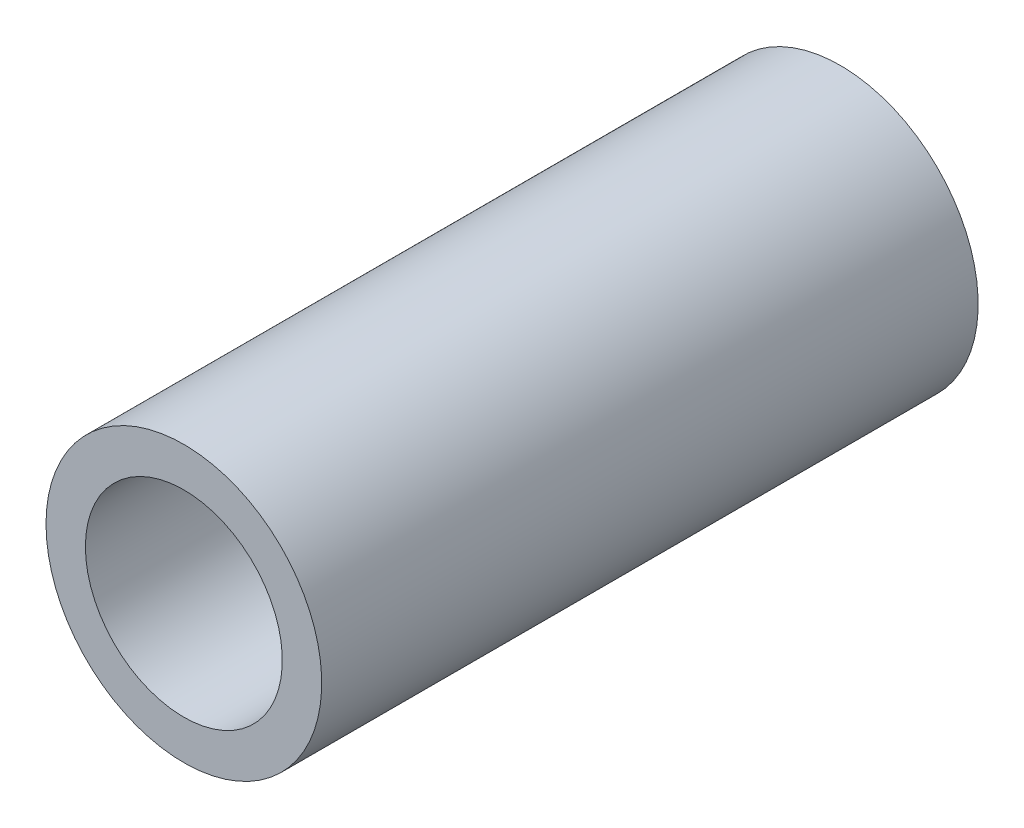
ISO-10303-21;
HEADER;
FILE_DESCRIPTION(('STEP AP214'),'2;1');
FILE_NAME('part.step','',(''),(''),'','','');
FILE_SCHEMA(('AUTOMOTIVE_DESIGN { 1 0 10303 214 1 1 1 1 }'));
ENDSEC;
DATA;
#1=APPLICATION_CONTEXT('core data for automotive mechanical design processes');
#2=APPLICATION_PROTOCOL_DEFINITION('international standard','automotive_design',2000,#1);
#3=PRODUCT_CONTEXT('',#1,'mechanical');
#4=PRODUCT('Part','Part','',(#3));
#5=PRODUCT_RELATED_PRODUCT_CATEGORY('part','',(#4));
#6=PRODUCT_DEFINITION_FORMATION('','',#4);
#7=PRODUCT_DEFINITION_CONTEXT('part definition',#1,'design');
#8=PRODUCT_DEFINITION('design','',#6,#7);
#9=PRODUCT_DEFINITION_SHAPE('','',#8);
#10=(LENGTH_UNIT() NAMED_UNIT(*) SI_UNIT(.MILLI.,.METRE.));
#11=(NAMED_UNIT(*) PLANE_ANGLE_UNIT() SI_UNIT($,.RADIAN.));
#12=(NAMED_UNIT(*) SI_UNIT($,.STERADIAN.) SOLID_ANGLE_UNIT());
#13=UNCERTAINTY_MEASURE_WITH_UNIT(LENGTH_MEASURE(1.E-05),#10,'distance_accuracy_value','');
#14=(GEOMETRIC_REPRESENTATION_CONTEXT(3) GLOBAL_UNCERTAINTY_ASSIGNED_CONTEXT((#13)) GLOBAL_UNIT_ASSIGNED_CONTEXT((#10,
#11,#12)) REPRESENTATION_CONTEXT('',''));
#15=CARTESIAN_POINT('',(0.,0.,0.));
#16=DIRECTION('',(0.,0.,1.));
#17=DIRECTION('',(1.,0.,0.));
#18=AXIS2_PLACEMENT_3D('',#15,#16,#17);
#19=CARTESIAN_POINT('',(0.,0.,100.));
#20=DIRECTION('',(0.,0.,1.));
#21=DIRECTION('',(1.,0.,0.));
#22=AXIS2_PLACEMENT_3D('',#19,#20,#21);
#23=PLANE('',#22);
#24=CARTESIAN_POINT('',(0.,0.,100.));
#25=DIRECTION('',(0.,0.,1.));
#26=DIRECTION('',(1.,0.,0.));
#27=AXIS2_PLACEMENT_3D('',#24,#25,#26);
#28=CIRCLE('',#27,21.);
#29=CARTESIAN_POINT('',(-21.,0.,100.));
#30=VERTEX_POINT('',#29);
#31=EDGE_CURVE('E11',#30,#30,#28,.T.);
#32=ORIENTED_EDGE('',*,*,#31,.T.);
#33=EDGE_LOOP('',(#32));
#34=FACE_BOUND('',#33,.T.);
#35=CARTESIAN_POINT('',(0.,0.,100.));
#36=DIRECTION('',(0.,0.,1.));
#37=DIRECTION('',(1.,0.,0.));
#38=AXIS2_PLACEMENT_3D('',#35,#36,#37);
#39=CIRCLE('',#38,15.);
#40=CARTESIAN_POINT('',(-15.,0.,100.));
#41=VERTEX_POINT('',#40);
#42=EDGE_CURVE('E50',#41,#41,#39,.T.);
#43=ORIENTED_EDGE('',*,*,#42,.F.);
#44=EDGE_LOOP('',(#43));
#45=FACE_BOUND('',#44,.T.);
#46=ADVANCED_FACE('F39',(#34,#45),#23,.T.);
#47=CARTESIAN_POINT('',(0.,0.,0.));
#48=DIRECTION('',(0.,0.,1.));
#49=DIRECTION('',(1.,0.,0.));
#50=AXIS2_PLACEMENT_3D('',#47,#48,#49);
#51=PLANE('',#50);
#52=CARTESIAN_POINT('',(0.,0.,0.));
#53=DIRECTION('',(0.,0.,1.));
#54=DIRECTION('',(1.,0.,0.));
#55=AXIS2_PLACEMENT_3D('',#52,#53,#54);
#56=CIRCLE('',#55,21.);
#57=CARTESIAN_POINT('',(-21.,0.,0.));
#58=VERTEX_POINT('',#57);
#59=EDGE_CURVE('E46',#58,#58,#56,.T.);
#60=ORIENTED_EDGE('',*,*,#59,.F.);
#61=EDGE_LOOP('',(#60));
#62=FACE_BOUND('',#61,.T.);
#63=CARTESIAN_POINT('',(0.,0.,0.));
#64=DIRECTION('',(0.,0.,1.));
#65=DIRECTION('',(1.,0.,0.));
#66=AXIS2_PLACEMENT_3D('',#63,#64,#65);
#67=CIRCLE('',#66,15.);
#68=CARTESIAN_POINT('',(-15.,0.,0.));
#69=VERTEX_POINT('',#68);
#70=EDGE_CURVE('E54',#69,#69,#67,.T.);
#71=ORIENTED_EDGE('',*,*,#70,.T.);
#72=EDGE_LOOP('',(#71));
#73=FACE_BOUND('',#72,.T.);
#74=ADVANCED_FACE('F60',(#62,#73),#51,.F.);
#75=CARTESIAN_POINT('',(0.,0.,100.));
#76=DIRECTION('',(0.,0.,-1.));
#77=DIRECTION('',(-1.,0.,0.));
#78=AXIS2_PLACEMENT_3D('',#75,#76,#77);
#79=CYLINDRICAL_SURFACE('',#78,21.);
#80=CARTESIAN_POINT('',(-21.,0.,100.));
#81=CARTESIAN_POINT('',(-21.,0.,98.9583333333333));
#82=CARTESIAN_POINT('',(-21.,0.,97.9166666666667));
#83=CARTESIAN_POINT('',(-21.,0.,95.8333333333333));
#84=CARTESIAN_POINT('',(-21.,0.,94.7916666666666));
#85=CARTESIAN_POINT('',(-21.,0.,92.7083333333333));
#86=CARTESIAN_POINT('',(-21.,0.,91.6666666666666));
#87=CARTESIAN_POINT('',(-21.,0.,89.5833333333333));
#88=CARTESIAN_POINT('',(-21.,0.,88.5416666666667));
#89=CARTESIAN_POINT('',(-21.,0.,86.4583333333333));
#90=CARTESIAN_POINT('',(-21.,0.,85.4166666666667));
#91=CARTESIAN_POINT('',(-21.,0.,83.3333333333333));
#92=CARTESIAN_POINT('',(-21.,0.,82.2916666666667));
#93=CARTESIAN_POINT('',(-21.,0.,80.2083333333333));
#94=CARTESIAN_POINT('',(-21.,0.,79.1666666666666));
#95=CARTESIAN_POINT('',(-21.,0.,77.0833333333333));
#96=CARTESIAN_POINT('',(-21.,0.,76.0416666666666));
#97=CARTESIAN_POINT('',(-21.,0.,73.9583333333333));
#98=CARTESIAN_POINT('',(-21.,0.,72.9166666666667));
#99=CARTESIAN_POINT('',(-21.,0.,70.8333333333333));
#100=CARTESIAN_POINT('',(-21.,0.,69.7916666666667));
#101=CARTESIAN_POINT('',(-21.,0.,67.7083333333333));
#102=CARTESIAN_POINT('',(-21.,0.,66.6666666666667));
#103=CARTESIAN_POINT('',(-21.,0.,64.5833333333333));
#104=CARTESIAN_POINT('',(-21.,0.,63.5416666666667));
#105=CARTESIAN_POINT('',(-21.,0.,61.4583333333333));
#106=CARTESIAN_POINT('',(-21.,0.,60.4166666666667));
#107=CARTESIAN_POINT('',(-21.,0.,58.3333333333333));
#108=CARTESIAN_POINT('',(-21.,0.,57.2916666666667));
#109=CARTESIAN_POINT('',(-21.,0.,55.2083333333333));
#110=CARTESIAN_POINT('',(-21.,0.,54.1666666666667));
#111=CARTESIAN_POINT('',(-21.,0.,52.0833333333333));
#112=CARTESIAN_POINT('',(-21.,0.,51.0416666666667));
#113=CARTESIAN_POINT('',(-21.,0.,48.9583333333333));
#114=CARTESIAN_POINT('',(-21.,0.,47.9166666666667));
#115=CARTESIAN_POINT('',(-21.,0.,45.8333333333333));
#116=CARTESIAN_POINT('',(-21.,0.,44.7916666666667));
#117=CARTESIAN_POINT('',(-21.,0.,42.7083333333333));
#118=CARTESIAN_POINT('',(-21.,0.,41.6666666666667));
#119=CARTESIAN_POINT('',(-21.,0.,39.5833333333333));
#120=CARTESIAN_POINT('',(-21.,0.,38.5416666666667));
#121=CARTESIAN_POINT('',(-21.,0.,36.4583333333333));
#122=CARTESIAN_POINT('',(-21.,0.,35.4166666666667));
#123=CARTESIAN_POINT('',(-21.,0.,33.3333333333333));
#124=CARTESIAN_POINT('',(-21.,0.,32.2916666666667));
#125=CARTESIAN_POINT('',(-21.,0.,30.2083333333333));
#126=CARTESIAN_POINT('',(-21.,0.,29.1666666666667));
#127=CARTESIAN_POINT('',(-21.,0.,27.0833333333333));
#128=CARTESIAN_POINT('',(-21.,0.,26.0416666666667));
#129=CARTESIAN_POINT('',(-21.,0.,23.9583333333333));
#130=CARTESIAN_POINT('',(-21.,0.,22.9166666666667));
#131=CARTESIAN_POINT('',(-21.,0.,20.8333333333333));
#132=CARTESIAN_POINT('',(-21.,0.,19.7916666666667));
#133=CARTESIAN_POINT('',(-21.,0.,17.7083333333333));
#134=CARTESIAN_POINT('',(-21.,0.,16.6666666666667));
#135=CARTESIAN_POINT('',(-21.,0.,14.5833333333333));
#136=CARTESIAN_POINT('',(-21.,0.,13.5416666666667));
#137=CARTESIAN_POINT('',(-21.,0.,11.4583333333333));
#138=CARTESIAN_POINT('',(-21.,0.,10.4166666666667));
#139=CARTESIAN_POINT('',(-21.,0.,8.33333333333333));
#140=CARTESIAN_POINT('',(-21.,0.,7.29166666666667));
#141=CARTESIAN_POINT('',(-21.,0.,5.20833333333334));
#142=CARTESIAN_POINT('',(-21.,0.,4.16666666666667));
#143=CARTESIAN_POINT('',(-21.,0.,2.08333333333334));
#144=CARTESIAN_POINT('',(-21.,0.,1.04166666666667));
#145=CARTESIAN_POINT('',(-21.,0.,0.));
#146=B_SPLINE_CURVE_WITH_KNOTS('',3,(#80,#81,#82,#83,#84,#85,#86,#87,#88,#89,#90,#91,#92,#93,
#94,#95,#96,#97,#98,#99,#100,#101,#102,#103,#104,#105,#106,#107,#108,#109,#110,#111,#112,#113,
#114,#115,#116,#117,#118,#119,#120,#121,#122,#123,#124,#125,#126,#127,#128,#129,#130,#131,#132,
#133,#134,#135,#136,#137,#138,#139,#140,#141,#142,#143,#144,#145),.UNSPECIFIED.,.F.,.F.,(4,2,2,
2,2,2,2,2,2,2,2,2,2,2,2,2,2,2,2,2,2,2,2,2,2,2,2,2,2,2,2,2,4),(0.,3.12499999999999,
6.24999999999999,9.37499999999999,12.5,15.625,18.75,21.875,25.,28.125,31.25,34.375,37.5,40.625,
43.75,46.875,50.,53.125,56.25,59.375,62.5,65.625,68.75,71.875,75.,78.125,81.25,84.375,87.5,
90.625,93.75,96.875,100.),.UNSPECIFIED.);
#147=EDGE_CURVE('BSEAM41',#30,#58,#146,.T.);
#148=ORIENTED_EDGE('',*,*,#31,.F.);
#149=ORIENTED_EDGE('',*,*,#59,.T.);
#150=ORIENTED_EDGE('',*,*,#147,.T.);
#151=ORIENTED_EDGE('',*,*,#147,.F.);
#152=EDGE_LOOP('',(#148,#150,#149,#151));
#153=FACE_BOUND('',#152,.T.);
#154=ADVANCED_FACE('F41',(#153),#79,.T.);
#155=CARTESIAN_POINT('',(0.,0.,100.));
#156=DIRECTION('',(0.,0.,-1.));
#157=DIRECTION('',(-1.,0.,0.));
#158=AXIS2_PLACEMENT_3D('',#155,#156,#157);
#159=CYLINDRICAL_SURFACE('',#158,15.);
#160=CARTESIAN_POINT('',(-15.,0.,100.));
#161=CARTESIAN_POINT('',(-15.,0.,98.9583333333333));
#162=CARTESIAN_POINT('',(-15.,0.,97.9166666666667));
#163=CARTESIAN_POINT('',(-15.,0.,95.8333333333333));
#164=CARTESIAN_POINT('',(-15.,0.,94.7916666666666));
#165=CARTESIAN_POINT('',(-15.,0.,92.7083333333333));
#166=CARTESIAN_POINT('',(-15.,0.,91.6666666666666));
#167=CARTESIAN_POINT('',(-15.,0.,89.5833333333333));
#168=CARTESIAN_POINT('',(-15.,0.,88.5416666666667));
#169=CARTESIAN_POINT('',(-15.,0.,86.4583333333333));
#170=CARTESIAN_POINT('',(-15.,0.,85.4166666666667));
#171=CARTESIAN_POINT('',(-15.,0.,83.3333333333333));
#172=CARTESIAN_POINT('',(-15.,0.,82.2916666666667));
#173=CARTESIAN_POINT('',(-15.,0.,80.2083333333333));
#174=CARTESIAN_POINT('',(-15.,0.,79.1666666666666));
#175=CARTESIAN_POINT('',(-15.,0.,77.0833333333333));
#176=CARTESIAN_POINT('',(-15.,0.,76.0416666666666));
#177=CARTESIAN_POINT('',(-15.,0.,73.9583333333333));
#178=CARTESIAN_POINT('',(-15.,0.,72.9166666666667));
#179=CARTESIAN_POINT('',(-15.,0.,70.8333333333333));
#180=CARTESIAN_POINT('',(-15.,0.,69.7916666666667));
#181=CARTESIAN_POINT('',(-15.,0.,67.7083333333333));
#182=CARTESIAN_POINT('',(-15.,0.,66.6666666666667));
#183=CARTESIAN_POINT('',(-15.,0.,64.5833333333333));
#184=CARTESIAN_POINT('',(-15.,0.,63.5416666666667));
#185=CARTESIAN_POINT('',(-15.,0.,61.4583333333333));
#186=CARTESIAN_POINT('',(-15.,0.,60.4166666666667));
#187=CARTESIAN_POINT('',(-15.,0.,58.3333333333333));
#188=CARTESIAN_POINT('',(-15.,0.,57.2916666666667));
#189=CARTESIAN_POINT('',(-15.,0.,55.2083333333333));
#190=CARTESIAN_POINT('',(-15.,0.,54.1666666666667));
#191=CARTESIAN_POINT('',(-15.,0.,52.0833333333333));
#192=CARTESIAN_POINT('',(-15.,0.,51.0416666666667));
#193=CARTESIAN_POINT('',(-15.,0.,48.9583333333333));
#194=CARTESIAN_POINT('',(-15.,0.,47.9166666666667));
#195=CARTESIAN_POINT('',(-15.,0.,45.8333333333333));
#196=CARTESIAN_POINT('',(-15.,0.,44.7916666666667));
#197=CARTESIAN_POINT('',(-15.,0.,42.7083333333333));
#198=CARTESIAN_POINT('',(-15.,0.,41.6666666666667));
#199=CARTESIAN_POINT('',(-15.,0.,39.5833333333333));
#200=CARTESIAN_POINT('',(-15.,0.,38.5416666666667));
#201=CARTESIAN_POINT('',(-15.,0.,36.4583333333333));
#202=CARTESIAN_POINT('',(-15.,0.,35.4166666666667));
#203=CARTESIAN_POINT('',(-15.,0.,33.3333333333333));
#204=CARTESIAN_POINT('',(-15.,0.,32.2916666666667));
#205=CARTESIAN_POINT('',(-15.,0.,30.2083333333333));
#206=CARTESIAN_POINT('',(-15.,0.,29.1666666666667));
#207=CARTESIAN_POINT('',(-15.,0.,27.0833333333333));
#208=CARTESIAN_POINT('',(-15.,0.,26.0416666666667));
#209=CARTESIAN_POINT('',(-15.,0.,23.9583333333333));
#210=CARTESIAN_POINT('',(-15.,0.,22.9166666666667));
#211=CARTESIAN_POINT('',(-15.,0.,20.8333333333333));
#212=CARTESIAN_POINT('',(-15.,0.,19.7916666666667));
#213=CARTESIAN_POINT('',(-15.,0.,17.7083333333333));
#214=CARTESIAN_POINT('',(-15.,0.,16.6666666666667));
#215=CARTESIAN_POINT('',(-15.,0.,14.5833333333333));
#216=CARTESIAN_POINT('',(-15.,0.,13.5416666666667));
#217=CARTESIAN_POINT('',(-15.,0.,11.4583333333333));
#218=CARTESIAN_POINT('',(-15.,0.,10.4166666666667));
#219=CARTESIAN_POINT('',(-15.,0.,8.33333333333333));
#220=CARTESIAN_POINT('',(-15.,0.,7.29166666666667));
#221=CARTESIAN_POINT('',(-15.,0.,5.20833333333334));
#222=CARTESIAN_POINT('',(-15.,0.,4.16666666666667));
#223=CARTESIAN_POINT('',(-15.,0.,2.08333333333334));
#224=CARTESIAN_POINT('',(-15.,0.,1.04166666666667));
#225=CARTESIAN_POINT('',(-15.,0.,0.));
#226=B_SPLINE_CURVE_WITH_KNOTS('',3,(#160,#161,#162,#163,#164,#165,#166,#167,#168,#169,#170,
#171,#172,#173,#174,#175,#176,#177,#178,#179,#180,#181,#182,#183,#184,#185,#186,#187,#188,#189,
#190,#191,#192,#193,#194,#195,#196,#197,#198,#199,#200,#201,#202,#203,#204,#205,#206,#207,#208,
#209,#210,#211,#212,#213,#214,#215,#216,#217,#218,#219,#220,#221,#222,#223,#224,#225),
.UNSPECIFIED.,.F.,.F.,(4,2,2,2,2,2,2,2,2,2,2,2,2,2,2,2,2,2,2,2,2,2,2,2,2,2,2,2,2,2,2,2,4),(0.,
3.12499999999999,6.24999999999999,9.37499999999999,12.5,15.625,18.75,21.875,25.,28.125,31.25,
34.375,37.5,40.625,43.75,46.875,50.,53.125,56.25,59.375,62.5,65.625,68.75,71.875,75.,78.125,
81.25,84.375,87.5,90.625,93.75,96.875,100.),.UNSPECIFIED.);
#227=EDGE_CURVE('BSEAM62',#41,#69,#226,.T.);
#228=ORIENTED_EDGE('',*,*,#42,.T.);
#229=ORIENTED_EDGE('',*,*,#70,.F.);
#230=ORIENTED_EDGE('',*,*,#227,.T.);
#231=ORIENTED_EDGE('',*,*,#227,.F.);
#232=EDGE_LOOP('',(#228,#230,#229,#231));
#233=FACE_BOUND('',#232,.T.);
#234=ADVANCED_FACE('F62',(#233),#159,.F.);
#235=CLOSED_SHELL('',(#46,#74,#154,#234));
#236=MANIFOLD_SOLID_BREP('B2',#235);
#237=ADVANCED_BREP_SHAPE_REPRESENTATION('',(#18,#236),#14);
#238=SHAPE_DEFINITION_REPRESENTATION(#9,#237);
ENDSEC;
END-ISO-10303-21;
